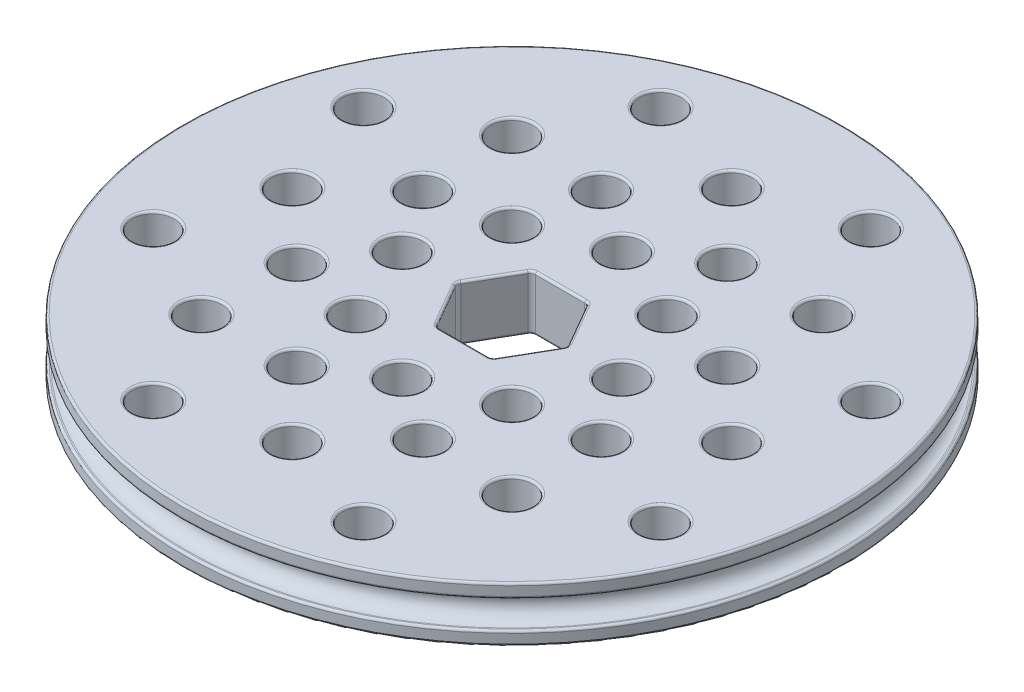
from build123d import *
from OCP.BRepFilletAPI import BRepFilletAPI_MakeFillet

# Parameters (mm, degrees)
SKETCH1_R          = 38.1
EXTRUDE1_DEPTH     = 3.175
SKETCH2_R          = 2.413
CUT_EXTRUDE1_DEPTH = 55.254423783
CIRPATTERN1_COUNT  = 8
FILLET1_R1         = 0.254
FILLET1_R2         = 0.635


with BuildPart() as part:
    # Sketch1 → Extrude1 (new, symmetric)
    with BuildSketch(Plane(origin=(0, 0, 0), x_dir=(1, 0, 0), z_dir=(0, 1, 0))):
        with Locations(Location((0, 0, 0), (0, 0, 270))):
            Circle(SKETCH1_R)
        Polygon((-6.423137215, 0), (-3.211568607, -5.5626), (3.211568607, -5.5626), (6.423137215, 0), (3.211568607, 5.5626), (-3.211568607, 5.5626), align=None, mode=Mode.SUBTRACT)
    extrude(amount=EXTRUDE1_DEPTH, both=True)

    # Sketch2 → Cut-Extrude1 (cut, through all)
    with BuildSketch(Plane(origin=(0, 3.175, 0), x_dir=(-1, 0, 0), z_dir=(0, 1, 0))):
        with Locations(Location((12.7, 0, 0), (0, 0, 90))):
            Circle(SKETCH2_R)
        with Locations(Location((25.4, 0, 0), (0, 0, 90))):
            Circle(SKETCH2_R)
        with Locations(Location((29.333175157, -12.150198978, 0), (0, 0, 90))):
            Circle(SKETCH2_R)
        with Locations(Location((17.599905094, -7.290119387, 0), (0, 0, 90))):
            Circle(SKETCH2_R)
    cut_extrude1 = extrude(amount=-CUT_EXTRUDE1_DEPTH, mode=Mode.SUBTRACT)

    # CirPattern1: Cut-Extrude1 ×8 about axis
    cirpattern1_axis = Axis((0, 0, 0), (0, 1, 0))
    for i in range(1, CIRPATTERN1_COUNT):
        add(cut_extrude1.rotate(cirpattern1_axis, i * 360 / CIRPATTERN1_COUNT), mode=Mode.SUBTRACT)

    # Sketch3 → Cut-Revolve1 (revolve, cut)
    with BuildSketch(Plane.XY, mode=Mode.PRIVATE) as cut_revolve1_sk:
        with BuildLine():
            Line((-38.1, 1.5875), (-37.703125, 1.5875))
            ThreePointArc((-37.703125, 1.5875), (-36.115625, 0), (-37.703125, -1.5875))
            Line((-37.703125, -1.5875), (-38.1, -1.5875))
            Line((-38.1, -1.5875), (-38.1, 1.5875))
        make_face()
    revolve(cut_revolve1_sk.sketch.rotate(Axis((0, 3.175, 0), (0, -1, 0)), 270), axis=Axis((0, 3.175, 0), (0, -1, 0)), mode=Mode.SUBTRACT)

    # Fillet1: one fillet with a radius per group of edges: ONE call of the kernel's fillet builder (fillet() takes one radius for all edges)
    fillet1_edges_1 = [part.edges().sort_by_distance(p)[0] for p in [
        (0, -3.175, 5.5626),
        (16.254263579, 3.175, 19.666760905),
        (16.254263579, -3.175, 19.666760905),
        (4.817352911, -3.175, 2.7813),
        (-2.413, 3.175, 25.4),
        (-2.413, -3.175, 25.4),
        (-19.666760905, 3.175, 16.254263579),
        (-19.666760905, -3.175, 16.254263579),
        (4.817352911, -3.175, -2.7813),
        (0, -3.175, -5.5626),
        (-10.443950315, 3.175, -31.03942382),
        (-10.443950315, -3.175, -31.03942382),
        (14.563198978, 3.175, -29.333175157),
        (14.563198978, -3.175, -29.333175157),
        (-4.817352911, 3.175, -2.7813),
        (31.03942382, 3.175, -10.443950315),
        (31.03942382, -3.175, -10.443950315),
        (-4.817352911, 3.175, 2.7813),
        (29.333175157, 3.175, 14.563198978),
        (29.333175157, -3.175, 14.563198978),
        (0, 3.175, 5.5626),
        (10.443950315, 3.175, 31.03942382),
        (10.443950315, -3.175, 31.03942382),
        (4.817352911, 3.175, 2.7813),
        (-14.563198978, 3.175, 29.333175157),
        (-14.563198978, -3.175, 29.333175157),
        (4.817352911, 3.175, -2.7813),
        (-31.03942382, 3.175, 10.443950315),
        (-31.03942382, -3.175, 10.443950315),
        (0, 3.175, -5.5626),
        (0, -1.5875, -38.1),
        (0, 1.5875, -38.1),
        (0, -3.175, -38.1),
        (-12.7, -3.175, -2.413),
        (-12.7, 3.175, -2.413),
        (-25.4, -3.175, -2.413),
        (-25.4, 3.175, -2.413),
        (-29.333175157, -3.175, -14.563198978),
        (-29.333175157, 3.175, -14.563198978),
        (-17.599905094, -3.175, -9.703119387),
        (-17.599905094, 3.175, -9.703119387),
        (0, 3.175, -38.1),
        (-5.583870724, 3.175, -19.306153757),
        (-5.583870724, -3.175, -19.306153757),
        (9.703119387, 3.175, -17.599905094),
        (9.703119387, -3.175, -17.599905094),
        (19.306153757, 3.175, -5.583870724),
        (19.306153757, -3.175, -5.583870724),
        (17.599905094, 3.175, 9.703119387),
        (17.599905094, -3.175, 9.703119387),
        (5.583870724, 3.175, 19.306153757),
        (5.583870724, -3.175, 19.306153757),
        (-9.703119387, 3.175, 17.599905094),
        (-9.703119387, -3.175, 17.599905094),
        (-19.306153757, 3.175, 5.583870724),
        (-19.306153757, -3.175, 5.583870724),
        (-7.274007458, 3.175, -10.686504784),
        (-7.274007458, -3.175, -10.686504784),
        (2.413, 3.175, -12.7),
        (2.413, -3.175, -12.7),
        (10.686504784, 3.175, -7.274007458),
        (10.686504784, -3.175, -7.274007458),
        (12.7, 3.175, 2.413),
        (12.7, -3.175, 2.413),
        (7.274007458, 3.175, 10.686504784),
        (7.274007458, -3.175, 10.686504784),
        (-2.413, 3.175, 12.7),
        (-2.413, -3.175, 12.7),
        (-10.686504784, 3.175, 7.274007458),
        (-10.686504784, -3.175, 7.274007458),
        (-16.254263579, 3.175, -19.666760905),
        (-16.254263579, -3.175, -19.666760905),
        (-4.817352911, -3.175, -2.7813),
        (2.413, 3.175, -25.4),
        (2.413, -3.175, -25.4),
        (19.666760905, 3.175, -16.254263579),
        (19.666760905, -3.175, -16.254263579),
        (-4.817352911, -3.175, 2.7813),
        (25.4, 3.175, 2.413),
        (25.4, -3.175, 2.413),
    ]]
    fillet1_edges_2 = [part.edges().sort_by_distance(p)[0] for p in [
        (-6.423137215, 0, 0),
        (-3.211568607, 0, 5.5626),
        (3.211568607, 0, 5.5626),
        (6.423137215, 0, 0),
        (3.211568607, 0, -5.5626),
        (-3.211568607, 0, -5.5626),
    ]]
    fillet1 = BRepFilletAPI_MakeFillet(part.part.solid().wrapped)
    for e in fillet1_edges_1:
        fillet1.Add(FILLET1_R1, e.wrapped)
    for e in fillet1_edges_2:
        fillet1.Add(FILLET1_R2, e.wrapped)
    add(Compound.cast(fillet1.Shape()), mode=Mode.REPLACE)


solid = part.part
